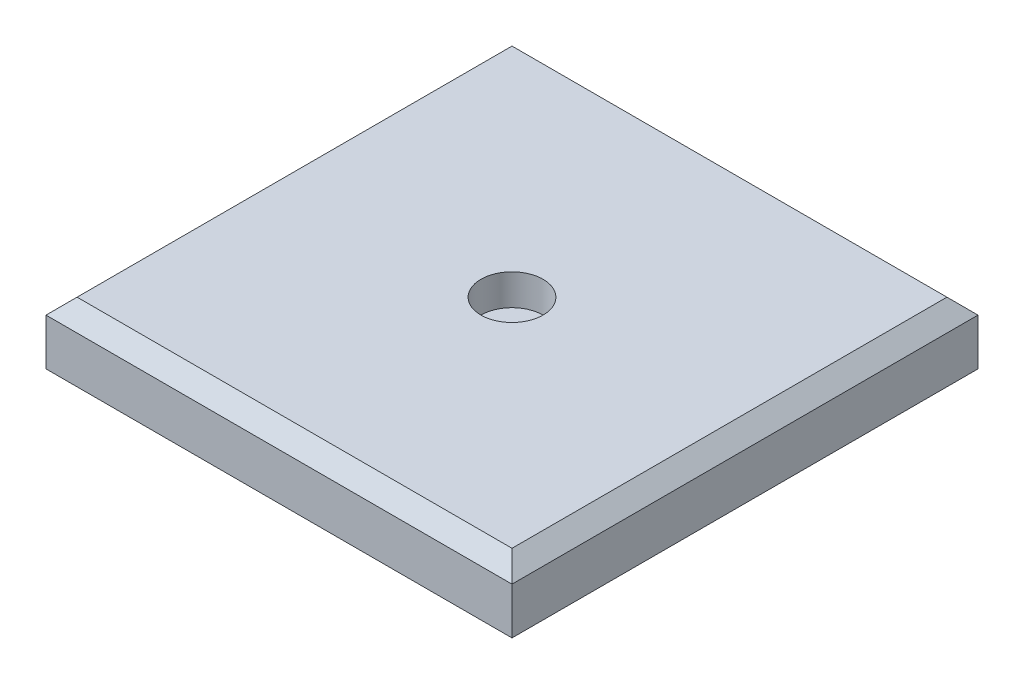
from build123d import *

# Parameters (mm, degrees)
SKETCH1_W      = 150
SKETCH1_H      = 150
EXTRUDE1_DEPTH = 20
SKETCH2_R      = 10
EXTRUDE2_DEPTH = 10
CHAMFER1_SIZE  = 5


with BuildPart() as part:
    # Sketch1 → Extrude1 (new body)
    with BuildSketch(Plane(origin=(0, 0, 0), x_dir=(1, 0, 0), z_dir=(0, 1, 0))):
        Rectangle(SKETCH1_W, SKETCH1_H)
    extrude(amount=EXTRUDE1_DEPTH)

    # Sketch2 → Extrude2 (cut)
    with BuildSketch(Plane(origin=(0, 20, 0), x_dir=(1, 0, 0), z_dir=(0, 1, 0))):
        with Locations(Location((0, 0, 0), (0, 0, 270))):
            Circle(SKETCH2_R)
    extrude(amount=-EXTRUDE2_DEPTH, mode=Mode.SUBTRACT)

    # Chamfer1
    chamfer1_edges = [part.edges().sort_by_distance(p)[0] for p in [
        (-75, 20, 0),
        (0, 20, 75),
        (75, 20, 0),
        (0, 20, -75),
    ]]
    chamfer(chamfer1_edges, length=CHAMFER1_SIZE)


solid = part.part
